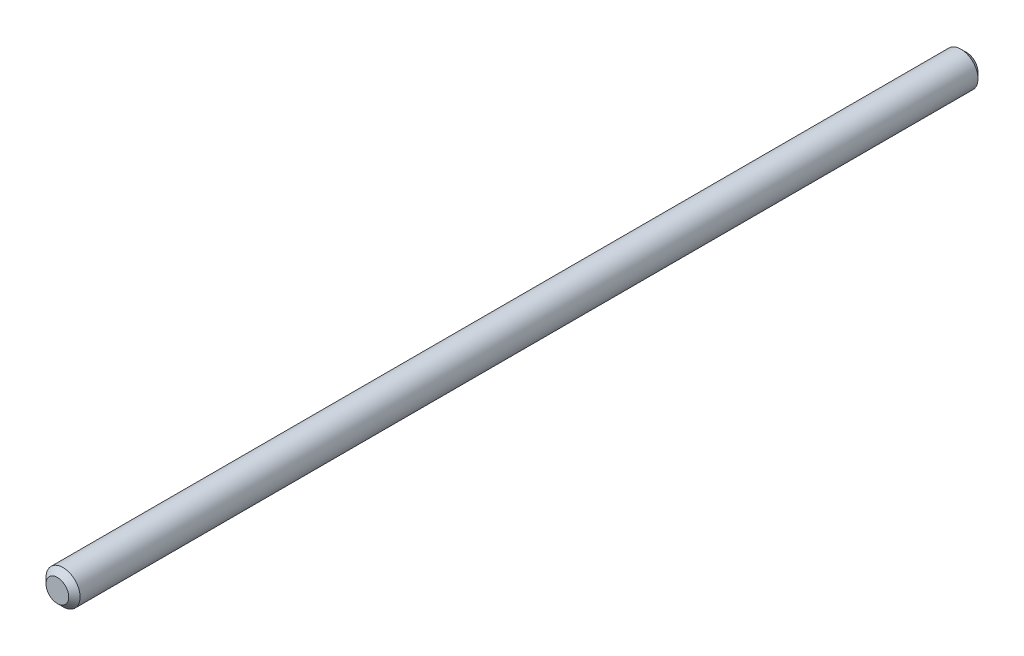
ISO-10303-21;
HEADER;
FILE_DESCRIPTION(('STEP AP214'),'2;1');
FILE_NAME('part.step','',(''),(''),'','','');
FILE_SCHEMA(('AUTOMOTIVE_DESIGN { 1 0 10303 214 1 1 1 1 }'));
ENDSEC;
DATA;
#1=APPLICATION_CONTEXT('core data for automotive mechanical design processes');
#2=APPLICATION_PROTOCOL_DEFINITION('international standard','automotive_design',2000,#1);
#3=PRODUCT_CONTEXT('',#1,'mechanical');
#4=PRODUCT('Part','Part','',(#3));
#5=PRODUCT_RELATED_PRODUCT_CATEGORY('part','',(#4));
#6=PRODUCT_DEFINITION_FORMATION('','',#4);
#7=PRODUCT_DEFINITION_CONTEXT('part definition',#1,'design');
#8=PRODUCT_DEFINITION('design','',#6,#7);
#9=PRODUCT_DEFINITION_SHAPE('','',#8);
#10=(LENGTH_UNIT() NAMED_UNIT(*) SI_UNIT(.MILLI.,.METRE.));
#11=(NAMED_UNIT(*) PLANE_ANGLE_UNIT() SI_UNIT($,.RADIAN.));
#12=(NAMED_UNIT(*) SI_UNIT($,.STERADIAN.) SOLID_ANGLE_UNIT());
#13=UNCERTAINTY_MEASURE_WITH_UNIT(LENGTH_MEASURE(1.E-05),#10,'distance_accuracy_value','');
#14=(GEOMETRIC_REPRESENTATION_CONTEXT(3) GLOBAL_UNCERTAINTY_ASSIGNED_CONTEXT((#13)) GLOBAL_UNIT_ASSIGNED_CONTEXT((#10,
#11,#12)) REPRESENTATION_CONTEXT('',''));
#15=CARTESIAN_POINT('',(0.,0.,0.));
#16=DIRECTION('',(0.,0.,1.));
#17=DIRECTION('',(1.,0.,0.));
#18=AXIS2_PLACEMENT_3D('',#15,#16,#17);
#19=CARTESIAN_POINT('',(0.,0.,79.9999999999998));
#20=DIRECTION('',(0.,0.,-0.999999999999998));
#21=DIRECTION('',(-1.00000000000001,0.,0.));
#22=AXIS2_PLACEMENT_3D('',#19,#20,#21);
#23=CYLINDRICAL_SURFACE('',#22,1.5);
#24=CARTESIAN_POINT('',(0.,0.,0.5));
#25=DIRECTION('',(0.,0.,0.999999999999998));
#26=DIRECTION('',(1.00000000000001,0.,0.));
#27=AXIS2_PLACEMENT_3D('',#24,#25,#26);
#28=CIRCLE('',#27,1.5);
#29=CARTESIAN_POINT('',(-1.50000000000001,0.,0.5));
#30=VERTEX_POINT('',#29);
#31=EDGE_CURVE('E32',#30,#30,#28,.T.);
#32=CARTESIAN_POINT('',(0.,0.,79.4999999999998));
#33=DIRECTION('',(0.,0.,0.999999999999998));
#34=DIRECTION('',(1.00000000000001,0.,0.));
#35=AXIS2_PLACEMENT_3D('',#32,#33,#34);
#36=CIRCLE('',#35,1.5);
#37=CARTESIAN_POINT('',(-1.50000000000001,0.,79.4999999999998));
#38=VERTEX_POINT('',#37);
#39=EDGE_CURVE('E36',#38,#38,#36,.F.);
#40=CARTESIAN_POINT('',(-1.50000000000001,0.,0.5));
#41=CARTESIAN_POINT('',(-1.50000000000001,0.,1.32291666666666));
#42=CARTESIAN_POINT('',(-1.50000000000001,0.,2.14583333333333));
#43=CARTESIAN_POINT('',(-1.50000000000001,0.,3.79166666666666));
#44=CARTESIAN_POINT('',(-1.50000000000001,0.,4.61458333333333));
#45=CARTESIAN_POINT('',(-1.50000000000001,0.,6.26041666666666));
#46=CARTESIAN_POINT('',(-1.50000000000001,0.,7.08333333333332));
#47=CARTESIAN_POINT('',(-1.50000000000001,0.,8.72916666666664));
#48=CARTESIAN_POINT('',(-1.50000000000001,0.,9.5520833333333));
#49=CARTESIAN_POINT('',(-1.50000000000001,0.,11.1979166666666));
#50=CARTESIAN_POINT('',(-1.50000000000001,0.,12.0208333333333));
#51=CARTESIAN_POINT('',(-1.50000000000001,0.,13.6666666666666));
#52=CARTESIAN_POINT('',(-1.50000000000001,0.,14.4895833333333));
#53=CARTESIAN_POINT('',(-1.50000000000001,0.,16.1354166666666));
#54=CARTESIAN_POINT('',(-1.50000000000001,0.,16.9583333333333));
#55=CARTESIAN_POINT('',(-1.50000000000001,0.,18.6041666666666));
#56=CARTESIAN_POINT('',(-1.50000000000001,0.,19.4270833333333));
#57=CARTESIAN_POINT('',(-1.50000000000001,0.,21.0729166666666));
#58=CARTESIAN_POINT('',(-1.50000000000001,0.,21.8958333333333));
#59=CARTESIAN_POINT('',(-1.50000000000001,0.,23.5416666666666));
#60=CARTESIAN_POINT('',(-1.50000000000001,0.,24.3645833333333));
#61=CARTESIAN_POINT('',(-1.50000000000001,0.,26.0104166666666));
#62=CARTESIAN_POINT('',(-1.50000000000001,0.,26.8333333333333));
#63=CARTESIAN_POINT('',(-1.50000000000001,0.,28.4791666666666));
#64=CARTESIAN_POINT('',(-1.50000000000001,0.,29.3020833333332));
#65=CARTESIAN_POINT('',(-1.50000000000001,0.,30.9479166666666));
#66=CARTESIAN_POINT('',(-1.50000000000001,0.,31.7708333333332));
#67=CARTESIAN_POINT('',(-1.50000000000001,0.,33.4166666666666));
#68=CARTESIAN_POINT('',(-1.50000000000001,0.,34.2395833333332));
#69=CARTESIAN_POINT('',(-1.50000000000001,0.,35.8854166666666));
#70=CARTESIAN_POINT('',(-1.50000000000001,0.,36.7083333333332));
#71=CARTESIAN_POINT('',(-1.50000000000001,0.,38.3541666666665));
#72=CARTESIAN_POINT('',(-1.50000000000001,0.,39.1770833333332));
#73=CARTESIAN_POINT('',(-1.50000000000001,0.,40.8229166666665));
#74=CARTESIAN_POINT('',(-1.50000000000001,0.,41.6458333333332));
#75=CARTESIAN_POINT('',(-1.50000000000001,0.,43.2916666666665));
#76=CARTESIAN_POINT('',(-1.50000000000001,0.,44.1145833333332));
#77=CARTESIAN_POINT('',(-1.50000000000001,0.,45.7604166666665));
#78=CARTESIAN_POINT('',(-1.50000000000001,0.,46.5833333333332));
#79=CARTESIAN_POINT('',(-1.50000000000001,0.,48.2291666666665));
#80=CARTESIAN_POINT('',(-1.50000000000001,0.,49.0520833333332));
#81=CARTESIAN_POINT('',(-1.50000000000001,0.,50.6979166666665));
#82=CARTESIAN_POINT('',(-1.50000000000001,0.,51.5208333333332));
#83=CARTESIAN_POINT('',(-1.50000000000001,0.,53.1666666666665));
#84=CARTESIAN_POINT('',(-1.50000000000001,0.,53.9895833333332));
#85=CARTESIAN_POINT('',(-1.50000000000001,0.,55.6354166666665));
#86=CARTESIAN_POINT('',(-1.50000000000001,0.,56.4583333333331));
#87=CARTESIAN_POINT('',(-1.50000000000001,0.,58.1041666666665));
#88=CARTESIAN_POINT('',(-1.50000000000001,0.,58.9270833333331));
#89=CARTESIAN_POINT('',(-1.50000000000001,0.,60.5729166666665));
#90=CARTESIAN_POINT('',(-1.50000000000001,0.,61.3958333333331));
#91=CARTESIAN_POINT('',(-1.50000000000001,0.,63.0416666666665));
#92=CARTESIAN_POINT('',(-1.50000000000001,0.,63.8645833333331));
#93=CARTESIAN_POINT('',(-1.50000000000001,0.,65.5104166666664));
#94=CARTESIAN_POINT('',(-1.50000000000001,0.,66.3333333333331));
#95=CARTESIAN_POINT('',(-1.50000000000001,0.,67.9791666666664));
#96=CARTESIAN_POINT('',(-1.50000000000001,0.,68.8020833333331));
#97=CARTESIAN_POINT('',(-1.50000000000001,0.,70.4479166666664));
#98=CARTESIAN_POINT('',(-1.50000000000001,0.,71.2708333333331));
#99=CARTESIAN_POINT('',(-1.50000000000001,0.,72.9166666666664));
#100=CARTESIAN_POINT('',(-1.50000000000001,0.,73.7395833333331));
#101=CARTESIAN_POINT('',(-1.50000000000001,0.,75.3854166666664));
#102=CARTESIAN_POINT('',(-1.50000000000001,0.,76.2083333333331));
#103=CARTESIAN_POINT('',(-1.50000000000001,0.,77.8541666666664));
#104=CARTESIAN_POINT('',(-1.50000000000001,0.,78.6770833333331));
#105=CARTESIAN_POINT('',(-1.50000000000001,0.,79.4999999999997));
#106=B_SPLINE_CURVE_WITH_KNOTS('',3,(#40,#41,#42,#43,#44,#45,#46,#47,#48,#49,#50,#51,#52,#53,
#54,#55,#56,#57,#58,#59,#60,#61,#62,#63,#64,#65,#66,#67,#68,#69,#70,#71,#72,#73,#74,#75,#76,#77,
#78,#79,#80,#81,#82,#83,#84,#85,#86,#87,#88,#89,#90,#91,#92,#93,#94,#95,#96,#97,#98,#99,#100,
#101,#102,#103,#104,#105),.UNSPECIFIED.,.F.,.F.,(4,2,2,2,2,2,2,2,2,2,2,2,2,2,2,2,2,2,2,2,2,2,2,
2,2,2,2,2,2,2,2,2,4),(0.,2.46874999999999,4.9375,7.40624999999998,9.87499999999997,12.34375,
14.8125,17.28125,19.7499999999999,22.2187499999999,24.6874999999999,27.1562499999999,
29.6249999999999,32.0937499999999,34.5624999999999,37.0312499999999,39.4999999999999,
41.9687499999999,44.4374999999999,46.9062499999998,49.3749999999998,51.8437499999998,
54.3124999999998,56.7812499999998,59.2499999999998,61.7187499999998,64.1874999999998,
66.6562499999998,69.1249999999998,71.5937499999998,74.0624999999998,76.5312499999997,
78.9999999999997),.UNSPECIFIED.);
#107=EDGE_CURVE('BSEAM22',#30,#38,#106,.T.);
#108=ORIENTED_EDGE('',*,*,#31,.T.);
#109=ORIENTED_EDGE('',*,*,#39,.T.);
#110=ORIENTED_EDGE('',*,*,#107,.T.);
#111=ORIENTED_EDGE('',*,*,#107,.F.);
#112=EDGE_LOOP('',(#108,#110,#109,#111));
#113=FACE_BOUND('',#112,.T.);
#114=ADVANCED_FACE('F22',(#113),#23,.T.);
#115=CARTESIAN_POINT('',(0.,0.,79.9999999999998));
#116=DIRECTION('',(0.,0.,0.999999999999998));
#117=DIRECTION('',(1.00000000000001,0.,0.));
#118=AXIS2_PLACEMENT_3D('',#115,#116,#117);
#119=PLANE('',#118);
#120=CARTESIAN_POINT('',(0.,0.,79.9999999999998));
#121=DIRECTION('',(0.,0.,0.999999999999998));
#122=DIRECTION('',(1.00000000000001,0.,0.));
#123=AXIS2_PLACEMENT_3D('',#120,#121,#122);
#124=CIRCLE('',#123,1.);
#125=CARTESIAN_POINT('',(-1.00000000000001,0.,79.9999999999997));
#126=VERTEX_POINT('',#125);
#127=EDGE_CURVE('E10',#126,#126,#124,.T.);
#128=ORIENTED_EDGE('',*,*,#127,.T.);
#129=EDGE_LOOP('',(#128));
#130=FACE_BOUND('',#129,.T.);
#131=ADVANCED_FACE('F55',(#130),#119,.T.);
#132=CARTESIAN_POINT('',(0.,0.,0.));
#133=DIRECTION('',(0.,0.,0.999999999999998));
#134=DIRECTION('',(1.00000000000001,0.,0.));
#135=AXIS2_PLACEMENT_3D('',#132,#133,#134);
#136=PLANE('',#135);
#137=CARTESIAN_POINT('',(0.,0.,0.));
#138=DIRECTION('',(0.,0.,0.999999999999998));
#139=DIRECTION('',(1.00000000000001,0.,0.));
#140=AXIS2_PLACEMENT_3D('',#137,#138,#139);
#141=CIRCLE('',#140,1.);
#142=CARTESIAN_POINT('',(1.00000000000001,0.,0.));
#143=VERTEX_POINT('',#142);
#144=EDGE_CURVE('E28',#143,#143,#141,.F.);
#145=ORIENTED_EDGE('',*,*,#144,.T.);
#146=EDGE_LOOP('',(#145));
#147=FACE_BOUND('',#146,.T.);
#148=ADVANCED_FACE('F51',(#147),#136,.F.);
#149=CARTESIAN_POINT('',(0.,0.,0.5));
#150=DIRECTION('',(0.,0.,0.999999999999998));
#151=DIRECTION('',(1.00000000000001,0.,0.));
#152=AXIS2_PLACEMENT_3D('',#149,#150,#151);
#153=CONICAL_SURFACE('',#152,1.5,0.785398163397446);
#154=ORIENTED_EDGE('',*,*,#144,.F.);
#155=EDGE_LOOP('',(#154));
#156=FACE_BOUND('',#155,.T.);
#157=ORIENTED_EDGE('',*,*,#31,.F.);
#158=EDGE_LOOP('',(#157));
#159=FACE_BOUND('',#158,.T.);
#160=ADVANCED_FACE('F46',(#156,#159),#153,.T.);
#161=CARTESIAN_POINT('',(0.,0.,79.9999999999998));
#162=DIRECTION('',(0.,0.,-0.999999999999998));
#163=DIRECTION('',(-1.00000000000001,0.,0.));
#164=AXIS2_PLACEMENT_3D('',#161,#162,#163);
#165=CONICAL_SURFACE('',#164,1.,0.785398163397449);
#166=CARTESIAN_POINT('',(-1.50000000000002,0.,79.4999999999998));
#167=CARTESIAN_POINT('',(-1.49479166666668,0.,79.5052083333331));
#168=CARTESIAN_POINT('',(-1.48958333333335,0.,79.5104166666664));
#169=CARTESIAN_POINT('',(-1.47916666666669,0.,79.5208333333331));
#170=CARTESIAN_POINT('',(-1.47395833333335,0.,79.5260416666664));
#171=CARTESIAN_POINT('',(-1.46354166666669,0.,79.5364583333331));
#172=CARTESIAN_POINT('',(-1.45833333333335,0.,79.5416666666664));
#173=CARTESIAN_POINT('',(-1.44791666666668,0.,79.5520833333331));
#174=CARTESIAN_POINT('',(-1.44270833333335,0.,79.5572916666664));
#175=CARTESIAN_POINT('',(-1.43229166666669,0.,79.5677083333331));
#176=CARTESIAN_POINT('',(-1.42708333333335,0.,79.5729166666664));
#177=CARTESIAN_POINT('',(-1.41666666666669,0.,79.5833333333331));
#178=CARTESIAN_POINT('',(-1.41145833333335,0.,79.5885416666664));
#179=CARTESIAN_POINT('',(-1.40104166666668,0.,79.5989583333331));
#180=CARTESIAN_POINT('',(-1.39583333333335,0.,79.6041666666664));
#181=CARTESIAN_POINT('',(-1.38541666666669,0.,79.6145833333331));
#182=CARTESIAN_POINT('',(-1.38020833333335,0.,79.6197916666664));
#183=CARTESIAN_POINT('',(-1.36979166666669,0.,79.6302083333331));
#184=CARTESIAN_POINT('',(-1.36458333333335,0.,79.6354166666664));
#185=CARTESIAN_POINT('',(-1.35416666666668,0.,79.6458333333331));
#186=CARTESIAN_POINT('',(-1.34895833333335,0.,79.6510416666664));
#187=CARTESIAN_POINT('',(-1.33854166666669,0.,79.6614583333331));
#188=CARTESIAN_POINT('',(-1.33333333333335,0.,79.6666666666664));
#189=CARTESIAN_POINT('',(-1.32291666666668,0.,79.6770833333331));
#190=CARTESIAN_POINT('',(-1.31770833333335,0.,79.6822916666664));
#191=CARTESIAN_POINT('',(-1.30729166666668,0.,79.6927083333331));
#192=CARTESIAN_POINT('',(-1.30208333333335,0.,79.6979166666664));
#193=CARTESIAN_POINT('',(-1.29166666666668,0.,79.7083333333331));
#194=CARTESIAN_POINT('',(-1.28645833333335,0.,79.7135416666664));
#195=CARTESIAN_POINT('',(-1.27604166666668,0.,79.7239583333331));
#196=CARTESIAN_POINT('',(-1.27083333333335,0.,79.7291666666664));
#197=CARTESIAN_POINT('',(-1.26041666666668,0.,79.7395833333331));
#198=CARTESIAN_POINT('',(-1.25520833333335,0.,79.7447916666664));
#199=CARTESIAN_POINT('',(-1.24479166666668,0.,79.7552083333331));
#200=CARTESIAN_POINT('',(-1.23958333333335,0.,79.7604166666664));
#201=CARTESIAN_POINT('',(-1.22916666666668,0.,79.7708333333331));
#202=CARTESIAN_POINT('',(-1.22395833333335,0.,79.7760416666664));
#203=CARTESIAN_POINT('',(-1.21354166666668,0.,79.7864583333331));
#204=CARTESIAN_POINT('',(-1.20833333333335,0.,79.7916666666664));
#205=CARTESIAN_POINT('',(-1.19791666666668,0.,79.8020833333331));
#206=CARTESIAN_POINT('',(-1.19270833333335,0.,79.8072916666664));
#207=CARTESIAN_POINT('',(-1.18229166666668,0.,79.8177083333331));
#208=CARTESIAN_POINT('',(-1.17708333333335,0.,79.8229166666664));
#209=CARTESIAN_POINT('',(-1.16666666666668,0.,79.8333333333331));
#210=CARTESIAN_POINT('',(-1.16145833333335,0.,79.8385416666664));
#211=CARTESIAN_POINT('',(-1.15104166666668,0.,79.8489583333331));
#212=CARTESIAN_POINT('',(-1.14583333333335,0.,79.8541666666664));
#213=CARTESIAN_POINT('',(-1.13541666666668,0.,79.8645833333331));
#214=CARTESIAN_POINT('',(-1.13020833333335,0.,79.8697916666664));
#215=CARTESIAN_POINT('',(-1.11979166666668,0.,79.8802083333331));
#216=CARTESIAN_POINT('',(-1.11458333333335,0.,79.8854166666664));
#217=CARTESIAN_POINT('',(-1.10416666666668,0.,79.8958333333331));
#218=CARTESIAN_POINT('',(-1.09895833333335,0.,79.9010416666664));
#219=CARTESIAN_POINT('',(-1.08854166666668,0.,79.9114583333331));
#220=CARTESIAN_POINT('',(-1.08333333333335,0.,79.9166666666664));
#221=CARTESIAN_POINT('',(-1.07291666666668,0.,79.9270833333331));
#222=CARTESIAN_POINT('',(-1.06770833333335,0.,79.9322916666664));
#223=CARTESIAN_POINT('',(-1.05729166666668,0.,79.9427083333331));
#224=CARTESIAN_POINT('',(-1.05208333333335,0.,79.9479166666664));
#225=CARTESIAN_POINT('',(-1.04166666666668,0.,79.9583333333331));
#226=CARTESIAN_POINT('',(-1.03645833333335,0.,79.9635416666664));
#227=CARTESIAN_POINT('',(-1.02604166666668,0.,79.9739583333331));
#228=CARTESIAN_POINT('',(-1.02083333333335,0.,79.9791666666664));
#229=CARTESIAN_POINT('',(-1.01041666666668,0.,79.9895833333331));
#230=CARTESIAN_POINT('',(-1.00520833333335,0.,79.9947916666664));
#231=CARTESIAN_POINT('',(-1.00000000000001,0.,79.9999999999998));
#232=B_SPLINE_CURVE_WITH_KNOTS('',3,(#166,#167,#168,#169,#170,#171,#172,#173,#174,#175,#176,
#177,#178,#179,#180,#181,#182,#183,#184,#185,#186,#187,#188,#189,#190,#191,#192,#193,#194,#195,
#196,#197,#198,#199,#200,#201,#202,#203,#204,#205,#206,#207,#208,#209,#210,#211,#212,#213,#214,
#215,#216,#217,#218,#219,#220,#221,#222,#223,#224,#225,#226,#227,#228,#229,#230,#231),
.UNSPECIFIED.,.F.,.F.,(4,2,2,2,2,2,2,2,2,2,2,2,2,2,2,2,2,2,2,2,2,2,2,2,2,2,2,2,2,2,2,2,4),(0.,
0.0220970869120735,0.044194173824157,0.0662912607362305,0.0883883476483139,0.110485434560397,
0.132582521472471,0.154679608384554,0.176776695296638,0.198873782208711,0.220970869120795,
0.243067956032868,0.265165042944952,0.287262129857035,0.309359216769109,0.331456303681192,
0.353553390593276,0.375650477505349,0.397747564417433,0.419844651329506,0.44194173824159,
0.464038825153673,0.486135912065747,0.50823299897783,0.530330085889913,0.552427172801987,
0.574524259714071,0.596621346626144,0.618718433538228,0.640815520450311,0.662912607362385,
0.685009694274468,0.707106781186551),.UNSPECIFIED.);
#233=EDGE_CURVE('BSEAM43',#38,#126,#232,.T.);
#234=ORIENTED_EDGE('',*,*,#39,.F.);
#235=ORIENTED_EDGE('',*,*,#127,.F.);
#236=ORIENTED_EDGE('',*,*,#233,.T.);
#237=ORIENTED_EDGE('',*,*,#233,.F.);
#238=EDGE_LOOP('',(#234,#236,#235,#237));
#239=FACE_BOUND('',#238,.T.);
#240=ADVANCED_FACE('F43',(#239),#165,.T.);
#241=CLOSED_SHELL('',(#114,#131,#148,#160,#240));
#242=MANIFOLD_SOLID_BREP('B2',#241);
#243=ADVANCED_BREP_SHAPE_REPRESENTATION('',(#18,#242),#14);
#244=SHAPE_DEFINITION_REPRESENTATION(#9,#243);
ENDSEC;
END-ISO-10303-21;
